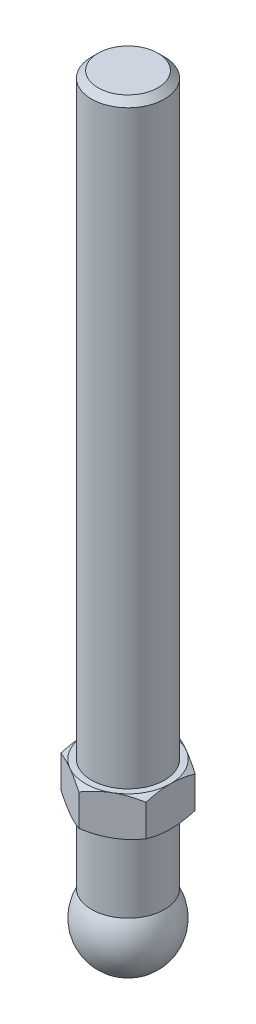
ISO-10303-21;
HEADER;
FILE_DESCRIPTION(('STEP AP214'),'2;1');
FILE_NAME('part.step','',(''),(''),'','','');
FILE_SCHEMA(('AUTOMOTIVE_DESIGN { 1 0 10303 214 1 1 1 1 }'));
ENDSEC;
DATA;
#1=APPLICATION_CONTEXT('core data for automotive mechanical design processes');
#2=APPLICATION_PROTOCOL_DEFINITION('international standard','automotive_design',2000,#1);
#3=PRODUCT_CONTEXT('',#1,'mechanical');
#4=PRODUCT('Part','Part','',(#3));
#5=PRODUCT_RELATED_PRODUCT_CATEGORY('part','',(#4));
#6=PRODUCT_DEFINITION_FORMATION('','',#4);
#7=PRODUCT_DEFINITION_CONTEXT('part definition',#1,'design');
#8=PRODUCT_DEFINITION('design','',#6,#7);
#9=PRODUCT_DEFINITION_SHAPE('','',#8);
#10=(LENGTH_UNIT() NAMED_UNIT(*) SI_UNIT(.MILLI.,.METRE.));
#11=(NAMED_UNIT(*) PLANE_ANGLE_UNIT() SI_UNIT($,.RADIAN.));
#12=(NAMED_UNIT(*) SI_UNIT($,.STERADIAN.) SOLID_ANGLE_UNIT());
#13=UNCERTAINTY_MEASURE_WITH_UNIT(LENGTH_MEASURE(1.E-05),#10,'distance_accuracy_value','');
#14=(GEOMETRIC_REPRESENTATION_CONTEXT(3) GLOBAL_UNCERTAINTY_ASSIGNED_CONTEXT((#13)) GLOBAL_UNIT_ASSIGNED_CONTEXT((#10,
#11,#12)) REPRESENTATION_CONTEXT('',''));
#15=CARTESIAN_POINT('',(0.,0.,0.));
#16=DIRECTION('',(0.,0.,1.));
#17=DIRECTION('',(1.,0.,0.));
#18=AXIS2_PLACEMENT_3D('',#15,#16,#17);
#19=CARTESIAN_POINT('',(0.,22.6,0.));
#20=DIRECTION('',(0.,-1.,0.));
#21=DIRECTION('',(0.,0.,-1.));
#22=AXIS2_PLACEMENT_3D('',#19,#20,#21);
#23=CONICAL_SURFACE('',#22,7.,1.0471975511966);
#24=CARTESIAN_POINT('',(-7.,18.5382826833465,12.1648696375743));
#25=CARTESIAN_POINT('',(-7.,18.683915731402,11.8738003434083));
#26=CARTESIAN_POINT('',(-7.,18.82854589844,11.5822239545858));
#27=CARTESIAN_POINT('',(-7.,19.1153156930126,10.997825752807));
#28=CARTESIAN_POINT('',(-7.,19.2574551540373,10.7050038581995));
#29=CARTESIAN_POINT('',(-7.,19.5390221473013,10.1173316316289));
#30=CARTESIAN_POINT('',(-7.,19.6784436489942,9.82247840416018));
#31=CARTESIAN_POINT('',(-7.,19.9536060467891,9.2310632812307));
#32=CARTESIAN_POINT('',(-7.,20.0893470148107,8.93450141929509));
#33=CARTESIAN_POINT('',(-7.,20.3623110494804,8.32593520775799));
#34=CARTESIAN_POINT('',(-7.,20.4993254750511,8.01383696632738));
#35=CARTESIAN_POINT('',(-7.,20.7671383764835,7.3869579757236));
#36=CARTESIAN_POINT('',(-7.,20.8979365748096,7.07217710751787));
#37=CARTESIAN_POINT('',(-7.,21.1515530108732,6.43962449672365));
#38=CARTESIAN_POINT('',(-7.,21.274376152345,6.12185473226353));
#39=CARTESIAN_POINT('',(-7.,21.5099016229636,5.48260317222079));
#40=CARTESIAN_POINT('',(-7.,21.6226050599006,5.16112178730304));
#41=CARTESIAN_POINT('',(-7.,21.8599014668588,4.43821731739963));
#42=CARTESIAN_POINT('',(-7.,21.981118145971,4.03566892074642));
#43=CARTESIAN_POINT('',(-7.,22.1969740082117,3.22331060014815));
#44=CARTESIAN_POINT('',(-7.,22.2916155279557,2.81350131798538));
#45=CARTESIAN_POINT('',(-7.,22.4069999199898,2.19742561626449));
#46=CARTESIAN_POINT('',(-7.,22.4408518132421,1.99359214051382));
#47=CARTESIAN_POINT('',(-7.,22.4993191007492,1.5846161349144));
#48=CARTESIAN_POINT('',(-7.,22.5239358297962,1.37947379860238));
#49=CARTESIAN_POINT('',(-7.,22.5631968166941,0.968289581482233));
#50=CARTESIAN_POINT('',(-7.,22.5778439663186,0.762247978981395));
#51=CARTESIAN_POINT('',(-7.,22.5967021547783,0.349683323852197));
#52=CARTESIAN_POINT('',(-7.,22.6009132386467,0.143160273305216));
#53=CARTESIAN_POINT('',(-7.,22.5987493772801,-0.271082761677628));
#54=CARTESIAN_POINT('',(-7.,22.5923100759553,-0.478802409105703));
#55=CARTESIAN_POINT('',(-7.,22.5689433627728,-0.893645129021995));
#56=CARTESIAN_POINT('',(-7.,22.5520159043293,-1.10076819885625));
#57=CARTESIAN_POINT('',(-7.,22.5082124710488,-1.51403043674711));
#58=CARTESIAN_POINT('',(-7.,22.4813327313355,-1.72016920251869));
#59=CARTESIAN_POINT('',(-7.,22.4184180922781,-2.13103319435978));
#60=CARTESIAN_POINT('',(-7.,22.3823828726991,-2.33575837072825));
#61=CARTESIAN_POINT('',(-7.,22.2605686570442,-2.95437912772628));
#62=CARTESIAN_POINT('',(-7.,22.1618729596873,-3.36575077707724));
#63=CARTESIAN_POINT('',(-7.,21.9384533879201,-4.1813801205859));
#64=CARTESIAN_POINT('',(-7.,21.8137148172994,-4.58563365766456));
#65=CARTESIAN_POINT('',(-7.,21.5733248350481,-5.30320893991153));
#66=CARTESIAN_POINT('',(-7.,21.4612875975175,-5.6177595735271));
#67=CARTESIAN_POINT('',(-7.,21.2278514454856,-6.24325021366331));
#68=CARTESIAN_POINT('',(-7.,21.1064551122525,-6.55419118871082));
#69=CARTESIAN_POINT('',(-7.,20.8562070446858,-7.17328528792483));
#70=CARTESIAN_POINT('',(-7.,20.7273503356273,-7.48143638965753));
#71=CARTESIAN_POINT('',(-7.,20.4637823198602,-8.09523802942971));
#72=CARTESIAN_POINT('',(-7.,20.3290706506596,-8.40088841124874));
#73=CARTESIAN_POINT('',(-7.,20.0607840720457,-8.99716345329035));
#74=CARTESIAN_POINT('',(-7.,19.9274031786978,-9.2878756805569));
#75=CARTESIAN_POINT('',(-7.,19.6571471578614,-9.86766295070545));
#76=CARTESIAN_POINT('',(-7.,19.52027208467,-10.1567380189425));
#77=CARTESIAN_POINT('',(-7.,19.2438978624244,-10.7329937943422));
#78=CARTESIAN_POINT('',(-7.,19.1044038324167,-11.0201769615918));
#79=CARTESIAN_POINT('',(-7.,18.8230228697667,-11.5933594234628));
#80=CARTESIAN_POINT('',(-7.,18.6811360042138,-11.879358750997));
#81=CARTESIAN_POINT('',(-7.,18.5382826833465,-12.1648696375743));
#82=B_SPLINE_CURVE_WITH_KNOTS('',3,(#24,#25,#26,#27,#28,#29,#30,#31,#32,#33,#34,#35,#36,#37,#38,
#39,#40,#41,#42,#43,#44,#45,#46,#47,#48,#49,#50,#51,#52,#53,#54,#55,#56,#57,#58,#59,#60,#61,#62,
#63,#64,#65,#66,#67,#68,#69,#70,#71,#72,#73,#74,#75,#76,#77,#78,#79,#80,#81),.UNSPECIFIED.,.F.,
.F.,(4,2,2,2,2,2,2,2,2,2,2,2,2,2,2,2,2,2,2,2,2,2,2,2,2,2,2,2,4),(0.,0.976413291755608,
1.95289161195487,2.93133423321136,3.90975772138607,4.93225217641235,5.95479223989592,
6.97669748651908,7.99849072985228,9.25906449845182,10.5195273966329,11.1392271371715,
11.7588372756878,12.3782676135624,12.9976952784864,13.6208795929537,14.2440666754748,
14.8674897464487,15.490934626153,16.7587972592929,18.027377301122,19.0289263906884,
20.0302002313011,21.0321496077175,22.0341611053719,22.9936838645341,23.9531917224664,
24.9109871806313,25.8687558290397),.UNSPECIFIED.);
#83=CARTESIAN_POINT('',(-7.,21.9747852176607,4.04145188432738));
#84=VERTEX_POINT('',#83);
#85=CARTESIAN_POINT('',(-7.,22.6,0.));
#86=VERTEX_POINT('',#85);
#87=EDGE_CURVE('E313',#84,#86,#82,.T.);
#88=ORIENTED_EDGE('',*,*,#87,.F.);
#89=CARTESIAN_POINT('',(0.0002,21.9747185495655,8.0830192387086));
#90=CARTESIAN_POINT('',(-0.153667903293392,22.0260001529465,7.99418356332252));
#91=CARTESIAN_POINT('',(-0.30810950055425,22.0749544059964,7.90501666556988));
#92=CARTESIAN_POINT('',(-0.618246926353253,22.1675672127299,7.72595873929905));
#93=CARTESIAN_POINT('',(-0.773943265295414,22.2112234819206,7.63606741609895));
#94=CARTESIAN_POINT('',(-1.24352516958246,22.3333884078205,7.36495417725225));
#95=CARTESIAN_POINT('',(-1.5592643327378,22.402874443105,7.18266208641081));
#96=CARTESIAN_POINT('',(-2.03176224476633,22.4843550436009,6.9098652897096));
#97=CARTESIAN_POINT('',(-2.18710922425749,22.5075665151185,6.82017566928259));
#98=CARTESIAN_POINT('',(-2.49850511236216,22.5464887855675,6.64039116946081));
#99=CARTESIAN_POINT('',(-2.65455395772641,22.5622002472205,6.55029632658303));
#100=CARTESIAN_POINT('',(-2.96692267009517,22.5857220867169,6.36995016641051));
#101=CARTESIAN_POINT('',(-3.12324202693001,22.5935414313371,6.27969914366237));
#102=CARTESIAN_POINT('',(-3.43601650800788,22.6011197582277,6.09911871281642));
#103=CARTESIAN_POINT('',(-3.59247162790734,22.600878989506,6.00878930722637));
#104=CARTESIAN_POINT('',(-4.02110687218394,22.5891402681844,5.76131663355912));
#105=CARTESIAN_POINT('',(-4.2931466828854,22.5694342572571,5.60425437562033));
#106=CARTESIAN_POINT('',(-4.8354194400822,22.5069465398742,5.29117305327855));
#107=CARTESIAN_POINT('',(-5.10565047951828,22.464143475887,5.13515508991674));
#108=CARTESIAN_POINT('',(-5.64901454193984,22.3571483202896,4.82144370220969));
#109=CARTESIAN_POINT('',(-5.92207900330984,22.2925029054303,4.66378986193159));
#110=CARTESIAN_POINT('',(-6.46413578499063,22.145783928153,4.35083323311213));
#111=CARTESIAN_POINT('',(-6.73313504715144,22.0637448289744,4.19552643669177));
#112=CARTESIAN_POINT('',(-7.0002,21.9747185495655,4.04133641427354));
#113=B_SPLINE_CURVE_WITH_KNOTS('',3,(#89,#90,#91,#92,#93,#94,#95,#96,#97,#98,#99,#100,#101,#102,
#103,#104,#105,#106,#107,#108,#109,#110,#111,#112),.UNSPECIFIED.,.F.,.F.,(4,2,2,2,2,2,2,2,2,2,2,
4),(0.,0.554727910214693,1.10969417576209,2.2219327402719,2.76443041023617,3.30688013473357,
3.8487128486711,4.39052882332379,5.33376515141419,6.27787517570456,7.2429241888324,
8.20607866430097),.UNSPECIFIED.);
#114=CARTESIAN_POINT('',(-3.5,22.6,6.06217782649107));
#115=VERTEX_POINT('',#114);
#116=EDGE_CURVE('E135',#115,#84,#113,.T.);
#117=ORIENTED_EDGE('',*,*,#116,.F.);
#118=CARTESIAN_POINT('',(0.,22.6,0.));
#119=DIRECTION('',(0.,-1.,0.));
#120=DIRECTION('',(0.,0.,-1.));
#121=AXIS2_PLACEMENT_3D('',#118,#119,#120);
#122=CIRCLE('',#121,7.);
#123=EDGE_CURVE('E283',#115,#86,#122,.T.);
#124=ORIENTED_EDGE('',*,*,#123,.T.);
#125=EDGE_LOOP('',(#88,#117,#124));
#126=FACE_BOUND('',#125,.T.);
#127=ADVANCED_FACE('F14',(#126),#23,.T.);
#128=CARTESIAN_POINT('',(-7.,21.9747852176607,-4.04145188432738));
#129=VERTEX_POINT('',#128);
#130=EDGE_CURVE('E193',#86,#129,#82,.T.);
#131=ORIENTED_EDGE('',*,*,#130,.F.);
#132=CARTESIAN_POINT('',(-3.5,22.6,-6.06217782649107));
#133=VERTEX_POINT('',#132);
#134=EDGE_CURVE('E195',#86,#133,#122,.T.);
#135=ORIENTED_EDGE('',*,*,#134,.T.);
#136=CARTESIAN_POINT('',(-7.0002,21.9747185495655,-4.04133641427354));
#137=CARTESIAN_POINT('',(-6.84633209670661,22.0260001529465,-4.13017208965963));
#138=CARTESIAN_POINT('',(-6.69189049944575,22.0749544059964,-4.21933898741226));
#139=CARTESIAN_POINT('',(-6.38175307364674,22.1675672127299,-4.39839691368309));
#140=CARTESIAN_POINT('',(-6.22605673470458,22.2112234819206,-4.48828823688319));
#141=CARTESIAN_POINT('',(-5.75647483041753,22.3333884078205,-4.75940147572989));
#142=CARTESIAN_POINT('',(-5.4407356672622,22.402874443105,-4.94169356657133));
#143=CARTESIAN_POINT('',(-4.96823775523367,22.4843550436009,-5.21449036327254));
#144=CARTESIAN_POINT('',(-4.81289077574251,22.5075665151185,-5.30417998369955));
#145=CARTESIAN_POINT('',(-4.50149488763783,22.5464887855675,-5.48396448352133));
#146=CARTESIAN_POINT('',(-4.34544604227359,22.5622002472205,-5.57405932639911));
#147=CARTESIAN_POINT('',(-4.03307732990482,22.5857220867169,-5.75440548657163));
#148=CARTESIAN_POINT('',(-3.87675797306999,22.5935414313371,-5.84465650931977));
#149=CARTESIAN_POINT('',(-3.56398349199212,22.6011197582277,-6.02523694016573));
#150=CARTESIAN_POINT('',(-3.40752837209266,22.600878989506,-6.11556634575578));
#151=CARTESIAN_POINT('',(-2.97889312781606,22.5891402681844,-6.36303901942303));
#152=CARTESIAN_POINT('',(-2.7068533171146,22.5694342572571,-6.52010127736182));
#153=CARTESIAN_POINT('',(-2.1645805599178,22.5069465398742,-6.83318259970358));
#154=CARTESIAN_POINT('',(-1.89434952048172,22.464143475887,-6.9892005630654));
#155=CARTESIAN_POINT('',(-1.35098545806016,22.3571483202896,-7.30291195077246));
#156=CARTESIAN_POINT('',(-1.07792099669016,22.2925029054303,-7.46056579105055));
#157=CARTESIAN_POINT('',(-0.53586421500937,22.145783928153,-7.77352241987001));
#158=CARTESIAN_POINT('',(-0.266864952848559,22.0637448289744,-7.92882921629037));
#159=CARTESIAN_POINT('',(0.000200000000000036,21.9747185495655,-8.0830192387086));
#160=B_SPLINE_CURVE_WITH_KNOTS('',3,(#136,#137,#138,#139,#140,#141,#142,#143,#144,#145,#146,
#147,#148,#149,#150,#151,#152,#153,#154,#155,#156,#157,#158,#159),.UNSPECIFIED.,.F.,.F.,(4,2,2,
2,2,2,2,2,2,2,2,4),(0.,0.554727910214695,1.10969417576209,2.2219327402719,2.76443041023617,
3.30688013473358,3.8487128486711,4.39052882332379,5.33376515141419,6.27787517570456,
7.2429241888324,8.20607866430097),.UNSPECIFIED.);
#161=EDGE_CURVE('E183',#129,#133,#160,.T.);
#162=ORIENTED_EDGE('',*,*,#161,.F.);
#163=EDGE_LOOP('',(#131,#135,#162));
#164=FACE_BOUND('',#163,.T.);
#165=ADVANCED_FACE('F192',(#164),#23,.T.);
#166=CARTESIAN_POINT('',(0.,21.9747852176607,-8.08290376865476));
#167=VERTEX_POINT('',#166);
#168=EDGE_CURVE('E197',#133,#167,#160,.T.);
#169=ORIENTED_EDGE('',*,*,#168,.F.);
#170=CARTESIAN_POINT('',(3.5,22.6,-6.06217782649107));
#171=VERTEX_POINT('',#170);
#172=EDGE_CURVE('E293',#133,#171,#122,.T.);
#173=ORIENTED_EDGE('',*,*,#172,.T.);
#174=CARTESIAN_POINT('',(-0.0002,21.9747185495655,-8.0830192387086));
#175=CARTESIAN_POINT('',(0.153667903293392,22.0260001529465,-7.99418356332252));
#176=CARTESIAN_POINT('',(0.30810950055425,22.0749544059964,-7.90501666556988));
#177=CARTESIAN_POINT('',(0.618246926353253,22.1675672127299,-7.72595873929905));
#178=CARTESIAN_POINT('',(0.773943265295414,22.2112234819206,-7.63606741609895));
#179=CARTESIAN_POINT('',(1.24352516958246,22.3333884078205,-7.36495417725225));
#180=CARTESIAN_POINT('',(1.5592643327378,22.402874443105,-7.18266208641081));
#181=CARTESIAN_POINT('',(2.03176224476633,22.4843550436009,-6.9098652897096));
#182=CARTESIAN_POINT('',(2.18710922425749,22.5075665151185,-6.82017566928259));
#183=CARTESIAN_POINT('',(2.49850511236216,22.5464887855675,-6.64039116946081));
#184=CARTESIAN_POINT('',(2.65455395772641,22.5622002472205,-6.55029632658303));
#185=CARTESIAN_POINT('',(2.96692267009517,22.5857220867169,-6.36995016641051));
#186=CARTESIAN_POINT('',(3.12324202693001,22.5935414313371,-6.27969914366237));
#187=CARTESIAN_POINT('',(3.43601650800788,22.6011197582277,-6.09911871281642));
#188=CARTESIAN_POINT('',(3.59247162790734,22.600878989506,-6.00878930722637));
#189=CARTESIAN_POINT('',(4.02110687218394,22.5891402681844,-5.76131663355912));
#190=CARTESIAN_POINT('',(4.2931466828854,22.5694342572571,-5.60425437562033));
#191=CARTESIAN_POINT('',(4.8354194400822,22.5069465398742,-5.29117305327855));
#192=CARTESIAN_POINT('',(5.10565047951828,22.464143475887,-5.13515508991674));
#193=CARTESIAN_POINT('',(5.64901454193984,22.3571483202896,-4.82144370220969));
#194=CARTESIAN_POINT('',(5.92207900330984,22.2925029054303,-4.66378986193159));
#195=CARTESIAN_POINT('',(6.46413578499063,22.145783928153,-4.35083323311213));
#196=CARTESIAN_POINT('',(6.73313504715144,22.0637448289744,-4.19552643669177));
#197=CARTESIAN_POINT('',(7.0002,21.9747185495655,-4.04133641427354));
#198=B_SPLINE_CURVE_WITH_KNOTS('',3,(#174,#175,#176,#177,#178,#179,#180,#181,#182,#183,#184,
#185,#186,#187,#188,#189,#190,#191,#192,#193,#194,#195,#196,#197),.UNSPECIFIED.,.F.,.F.,(4,2,2,
2,2,2,2,2,2,2,2,4),(0.,0.554727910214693,1.10969417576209,2.2219327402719,2.76443041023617,
3.30688013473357,3.8487128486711,4.39052882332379,5.33376515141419,6.27787517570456,
7.2429241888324,8.20607866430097),.UNSPECIFIED.);
#199=EDGE_CURVE('E243',#167,#171,#198,.T.);
#200=ORIENTED_EDGE('',*,*,#199,.F.);
#201=EDGE_LOOP('',(#169,#173,#200));
#202=FACE_BOUND('',#201,.T.);
#203=ADVANCED_FACE('F346',(#202),#23,.T.);
#204=CARTESIAN_POINT('',(7.,21.9747852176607,-4.04145188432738));
#205=VERTEX_POINT('',#204);
#206=EDGE_CURVE('E238',#171,#205,#198,.T.);
#207=ORIENTED_EDGE('',*,*,#206,.F.);
#208=CARTESIAN_POINT('',(7.,22.6,0.));
#209=VERTEX_POINT('',#208);
#210=EDGE_CURVE('E288',#171,#209,#122,.T.);
#211=ORIENTED_EDGE('',*,*,#210,.T.);
#212=CARTESIAN_POINT('',(7.,18.5382826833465,-12.1648696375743));
#213=CARTESIAN_POINT('',(7.,18.683915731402,-11.8738003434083));
#214=CARTESIAN_POINT('',(7.,18.82854589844,-11.5822239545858));
#215=CARTESIAN_POINT('',(7.,19.1153156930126,-10.997825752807));
#216=CARTESIAN_POINT('',(7.,19.2574551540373,-10.7050038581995));
#217=CARTESIAN_POINT('',(7.,19.5390221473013,-10.1173316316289));
#218=CARTESIAN_POINT('',(7.,19.6784436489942,-9.82247840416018));
#219=CARTESIAN_POINT('',(7.,19.9536060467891,-9.2310632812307));
#220=CARTESIAN_POINT('',(7.,20.0893470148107,-8.93450141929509));
#221=CARTESIAN_POINT('',(7.,20.3623110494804,-8.32593520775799));
#222=CARTESIAN_POINT('',(7.,20.4993254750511,-8.01383696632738));
#223=CARTESIAN_POINT('',(7.,20.7671383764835,-7.3869579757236));
#224=CARTESIAN_POINT('',(7.,20.8979365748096,-7.07217710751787));
#225=CARTESIAN_POINT('',(7.,21.1515530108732,-6.43962449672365));
#226=CARTESIAN_POINT('',(7.,21.274376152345,-6.12185473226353));
#227=CARTESIAN_POINT('',(7.,21.5099016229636,-5.48260317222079));
#228=CARTESIAN_POINT('',(7.,21.6226050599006,-5.16112178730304));
#229=CARTESIAN_POINT('',(7.,21.8599014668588,-4.43821731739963));
#230=CARTESIAN_POINT('',(7.,21.981118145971,-4.03566892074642));
#231=CARTESIAN_POINT('',(7.,22.1969740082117,-3.22331060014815));
#232=CARTESIAN_POINT('',(7.,22.2916155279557,-2.81350131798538));
#233=CARTESIAN_POINT('',(7.,22.4069999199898,-2.19742561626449));
#234=CARTESIAN_POINT('',(7.,22.4408518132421,-1.99359214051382));
#235=CARTESIAN_POINT('',(7.,22.4993191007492,-1.5846161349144));
#236=CARTESIAN_POINT('',(7.,22.5239358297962,-1.37947379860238));
#237=CARTESIAN_POINT('',(7.,22.5631968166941,-0.968289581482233));
#238=CARTESIAN_POINT('',(7.,22.5778439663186,-0.762247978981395));
#239=CARTESIAN_POINT('',(7.,22.5967021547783,-0.349683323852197));
#240=CARTESIAN_POINT('',(7.,22.6009132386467,-0.143160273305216));
#241=CARTESIAN_POINT('',(7.,22.5987493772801,0.271082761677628));
#242=CARTESIAN_POINT('',(7.,22.5923100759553,0.478802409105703));
#243=CARTESIAN_POINT('',(7.,22.5689433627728,0.893645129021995));
#244=CARTESIAN_POINT('',(7.,22.5520159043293,1.10076819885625));
#245=CARTESIAN_POINT('',(7.,22.5082124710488,1.51403043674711));
#246=CARTESIAN_POINT('',(7.,22.4813327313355,1.72016920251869));
#247=CARTESIAN_POINT('',(7.,22.4184180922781,2.13103319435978));
#248=CARTESIAN_POINT('',(7.,22.3823828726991,2.33575837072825));
#249=CARTESIAN_POINT('',(7.,22.2605686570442,2.95437912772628));
#250=CARTESIAN_POINT('',(7.,22.1618729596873,3.36575077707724));
#251=CARTESIAN_POINT('',(7.,21.9384533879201,4.1813801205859));
#252=CARTESIAN_POINT('',(7.,21.8137148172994,4.58563365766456));
#253=CARTESIAN_POINT('',(7.,21.5733248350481,5.30320893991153));
#254=CARTESIAN_POINT('',(7.,21.4612875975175,5.6177595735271));
#255=CARTESIAN_POINT('',(7.,21.2278514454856,6.24325021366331));
#256=CARTESIAN_POINT('',(7.,21.1064551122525,6.55419118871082));
#257=CARTESIAN_POINT('',(7.,20.8562070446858,7.17328528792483));
#258=CARTESIAN_POINT('',(7.,20.7273503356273,7.48143638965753));
#259=CARTESIAN_POINT('',(7.,20.4637823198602,8.09523802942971));
#260=CARTESIAN_POINT('',(7.,20.3290706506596,8.40088841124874));
#261=CARTESIAN_POINT('',(7.,20.0607840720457,8.99716345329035));
#262=CARTESIAN_POINT('',(7.,19.9274031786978,9.2878756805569));
#263=CARTESIAN_POINT('',(7.,19.6571471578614,9.86766295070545));
#264=CARTESIAN_POINT('',(7.,19.52027208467,10.1567380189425));
#265=CARTESIAN_POINT('',(7.,19.2438978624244,10.7329937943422));
#266=CARTESIAN_POINT('',(7.,19.1044038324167,11.0201769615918));
#267=CARTESIAN_POINT('',(7.,18.8230228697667,11.5933594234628));
#268=CARTESIAN_POINT('',(7.,18.6811360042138,11.879358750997));
#269=CARTESIAN_POINT('',(7.,18.5382826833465,12.1648696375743));
#270=B_SPLINE_CURVE_WITH_KNOTS('',3,(#212,#213,#214,#215,#216,#217,#218,#219,#220,#221,#222,
#223,#224,#225,#226,#227,#228,#229,#230,#231,#232,#233,#234,#235,#236,#237,#238,#239,#240,#241,
#242,#243,#244,#245,#246,#247,#248,#249,#250,#251,#252,#253,#254,#255,#256,#257,#258,#259,#260,
#261,#262,#263,#264,#265,#266,#267,#268,#269),.UNSPECIFIED.,.F.,.F.,(4,2,2,2,2,2,2,2,2,2,2,2,2,
2,2,2,2,2,2,2,2,2,2,2,2,2,2,2,4),(0.,0.976413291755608,1.95289161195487,2.93133423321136,
3.90975772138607,4.93225217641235,5.95479223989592,6.97669748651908,7.99849072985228,
9.25906449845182,10.5195273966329,11.1392271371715,11.7588372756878,12.3782676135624,
12.9976952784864,13.6208795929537,14.2440666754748,14.8674897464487,15.490934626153,
16.7587972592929,18.027377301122,19.0289263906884,20.0302002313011,21.0321496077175,
22.0341611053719,22.9936838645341,23.9531917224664,24.9109871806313,25.8687558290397),.UNSPECIFIED.);
#271=EDGE_CURVE('E249',#205,#209,#270,.T.);
#272=ORIENTED_EDGE('',*,*,#271,.F.);
#273=EDGE_LOOP('',(#207,#211,#272));
#274=FACE_BOUND('',#273,.T.);
#275=ADVANCED_FACE('F356',(#274),#23,.T.);
#276=CARTESIAN_POINT('',(7.,21.9747852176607,4.04145188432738));
#277=VERTEX_POINT('',#276);
#278=EDGE_CURVE('E251',#209,#277,#270,.T.);
#279=ORIENTED_EDGE('',*,*,#278,.F.);
#280=CARTESIAN_POINT('',(3.5,22.6,6.06217782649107));
#281=VERTEX_POINT('',#280);
#282=EDGE_CURVE('E281',#209,#281,#122,.T.);
#283=ORIENTED_EDGE('',*,*,#282,.T.);
#284=CARTESIAN_POINT('',(7.0002,21.9747185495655,4.04133641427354));
#285=CARTESIAN_POINT('',(6.84633209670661,22.0260001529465,4.13017208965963));
#286=CARTESIAN_POINT('',(6.69189049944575,22.0749544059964,4.21933898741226));
#287=CARTESIAN_POINT('',(6.38175307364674,22.1675672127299,4.39839691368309));
#288=CARTESIAN_POINT('',(6.22605673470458,22.2112234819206,4.48828823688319));
#289=CARTESIAN_POINT('',(5.75647483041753,22.3333884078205,4.75940147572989));
#290=CARTESIAN_POINT('',(5.4407356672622,22.402874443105,4.94169356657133));
#291=CARTESIAN_POINT('',(4.96823775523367,22.4843550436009,5.21449036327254));
#292=CARTESIAN_POINT('',(4.81289077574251,22.5075665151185,5.30417998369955));
#293=CARTESIAN_POINT('',(4.50149488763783,22.5464887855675,5.48396448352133));
#294=CARTESIAN_POINT('',(4.34544604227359,22.5622002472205,5.57405932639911));
#295=CARTESIAN_POINT('',(4.03307732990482,22.5857220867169,5.75440548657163));
#296=CARTESIAN_POINT('',(3.87675797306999,22.5935414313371,5.84465650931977));
#297=CARTESIAN_POINT('',(3.56398349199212,22.6011197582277,6.02523694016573));
#298=CARTESIAN_POINT('',(3.40752837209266,22.600878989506,6.11556634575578));
#299=CARTESIAN_POINT('',(2.97889312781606,22.5891402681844,6.36303901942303));
#300=CARTESIAN_POINT('',(2.7068533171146,22.5694342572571,6.52010127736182));
#301=CARTESIAN_POINT('',(2.1645805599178,22.5069465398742,6.83318259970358));
#302=CARTESIAN_POINT('',(1.89434952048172,22.464143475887,6.9892005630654));
#303=CARTESIAN_POINT('',(1.35098545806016,22.3571483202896,7.30291195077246));
#304=CARTESIAN_POINT('',(1.07792099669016,22.2925029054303,7.46056579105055));
#305=CARTESIAN_POINT('',(0.53586421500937,22.145783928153,7.77352241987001));
#306=CARTESIAN_POINT('',(0.266864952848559,22.0637448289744,7.92882921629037));
#307=CARTESIAN_POINT('',(-0.000200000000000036,21.9747185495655,8.0830192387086));
#308=B_SPLINE_CURVE_WITH_KNOTS('',3,(#284,#285,#286,#287,#288,#289,#290,#291,#292,#293,#294,
#295,#296,#297,#298,#299,#300,#301,#302,#303,#304,#305,#306,#307),.UNSPECIFIED.,.F.,.F.,(4,2,2,
2,2,2,2,2,2,2,2,4),(0.,0.554727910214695,1.10969417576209,2.2219327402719,2.76443041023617,
3.30688013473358,3.8487128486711,4.39052882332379,5.33376515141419,6.27787517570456,
7.2429241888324,8.20607866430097),.UNSPECIFIED.);
#309=EDGE_CURVE('E126',#277,#281,#308,.T.);
#310=ORIENTED_EDGE('',*,*,#309,.F.);
#311=EDGE_LOOP('',(#279,#283,#310));
#312=FACE_BOUND('',#311,.T.);
#313=ADVANCED_FACE('F285',(#312),#23,.T.);
#314=CARTESIAN_POINT('',(0.,21.9747852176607,8.08290376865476));
#315=VERTEX_POINT('',#314);
#316=EDGE_CURVE('E116',#281,#315,#308,.T.);
#317=ORIENTED_EDGE('',*,*,#316,.F.);
#318=EDGE_CURVE('E274',#281,#115,#122,.T.);
#319=ORIENTED_EDGE('',*,*,#318,.T.);
#320=EDGE_CURVE('E29',#315,#115,#113,.T.);
#321=ORIENTED_EDGE('',*,*,#320,.F.);
#322=EDGE_LOOP('',(#317,#319,#321));
#323=FACE_BOUND('',#322,.T.);
#324=ADVANCED_FACE('F273',(#323),#23,.T.);
#325=CARTESIAN_POINT('',(0.,120.6,0.));
#326=DIRECTION('',(0.,-1.,0.));
#327=DIRECTION('',(0.,0.,-1.));
#328=AXIS2_PLACEMENT_3D('',#325,#326,#327);
#329=PLANE('',#328);
#330=CARTESIAN_POINT('',(0.,120.6,0.));
#331=DIRECTION('',(0.,-1.,0.));
#332=DIRECTION('',(0.,0.,-1.));
#333=AXIS2_PLACEMENT_3D('',#330,#331,#332);
#334=CIRCLE('',#333,4.9265);
#335=CARTESIAN_POINT('',(0.,120.6,-4.9265));
#336=VERTEX_POINT('',#335);
#337=EDGE_CURVE('E22',#336,#336,#334,.T.);
#338=ORIENTED_EDGE('',*,*,#337,.F.);
#339=EDGE_LOOP('',(#338));
#340=FACE_BOUND('',#339,.T.);
#341=ADVANCED_FACE('F16',(#340),#329,.F.);
#342=CARTESIAN_POINT('',(0.,120.6,0.));
#343=DIRECTION('',(0.,-1.,0.));
#344=DIRECTION('',(0.,0.,-1.));
#345=AXIS2_PLACEMENT_3D('',#342,#343,#344);
#346=CONICAL_SURFACE('',#345,4.9265,0.785398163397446);
#347=CARTESIAN_POINT('',(0.,119.5265,0.));
#348=DIRECTION('',(0.,-1.,0.));
#349=DIRECTION('',(0.,0.,-1.));
#350=AXIS2_PLACEMENT_3D('',#347,#348,#349);
#351=CIRCLE('',#350,6.);
#352=CARTESIAN_POINT('',(0.,119.5265,-6.));
#353=VERTEX_POINT('',#352);
#354=EDGE_CURVE('E290',#353,#353,#351,.T.);
#355=ORIENTED_EDGE('',*,*,#354,.F.);
#356=EDGE_LOOP('',(#355));
#357=FACE_BOUND('',#356,.T.);
#358=ORIENTED_EDGE('',*,*,#337,.T.);
#359=EDGE_LOOP('',(#358));
#360=FACE_BOUND('',#359,.T.);
#361=ADVANCED_FACE('F354',(#357,#360),#346,.T.);
#362=CARTESIAN_POINT('',(0.,-7.,0.));
#363=DIRECTION('',(0.,-1.,0.));
#364=DIRECTION('',(0.,0.,-1.));
#365=AXIS2_PLACEMENT_3D('',#362,#363,#364);
#366=CYLINDRICAL_SURFACE('',#365,6.);
#367=CARTESIAN_POINT('',(0.,22.6,0.));
#368=DIRECTION('',(0.,-1.,0.));
#369=DIRECTION('',(0.,0.,-1.));
#370=AXIS2_PLACEMENT_3D('',#367,#368,#369);
#371=CIRCLE('',#370,6.);
#372=CARTESIAN_POINT('',(0.,22.6,-6.));
#373=VERTEX_POINT('',#372);
#374=EDGE_CURVE('E287',#373,#373,#371,.T.);
#375=ORIENTED_EDGE('',*,*,#374,.F.);
#376=EDGE_LOOP('',(#375));
#377=FACE_BOUND('',#376,.T.);
#378=ORIENTED_EDGE('',*,*,#354,.T.);
#379=EDGE_LOOP('',(#378));
#380=FACE_BOUND('',#379,.T.);
#381=ADVANCED_FACE('F439',(#377,#380),#366,.T.);
#382=CARTESIAN_POINT('',(6.,22.6,0.));
#383=DIRECTION('',(0.,-1.,0.));
#384=DIRECTION('',(0.,0.,-1.));
#385=AXIS2_PLACEMENT_3D('',#382,#383,#384);
#386=PLANE('',#385);
#387=ORIENTED_EDGE('',*,*,#282,.F.);
#388=ORIENTED_EDGE('',*,*,#210,.F.);
#389=ORIENTED_EDGE('',*,*,#172,.F.);
#390=ORIENTED_EDGE('',*,*,#134,.F.);
#391=ORIENTED_EDGE('',*,*,#123,.F.);
#392=ORIENTED_EDGE('',*,*,#318,.F.);
#393=EDGE_LOOP('',(#387,#388,#389,#390,#391,#392));
#394=FACE_BOUND('',#393,.T.);
#395=ORIENTED_EDGE('',*,*,#374,.T.);
#396=EDGE_LOOP('',(#395));
#397=FACE_BOUND('',#396,.T.);
#398=ADVANCED_FACE('F278',(#394,#397),#386,.F.);
#399=CARTESIAN_POINT('',(-7.,16.15,-4.04145188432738));
#400=DIRECTION('',(-1.,0.,0.));
#401=DIRECTION('',(0.,0.,1.));
#402=AXIS2_PLACEMENT_3D('',#399,#400,#401);
#403=PLANE('',#402);
#404=ORIENTED_EDGE('',*,*,#87,.T.);
#405=ORIENTED_EDGE('',*,*,#130,.T.);
#406=DIRECTION('',(0.,1.,0.));
#407=VECTOR('',#406,1.);
#408=CARTESIAN_POINT('',(-7.,16.15,-4.04145188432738));
#409=LINE('',#408,#407);
#410=CARTESIAN_POINT('',(-7.,16.7752147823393,-4.04145188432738));
#411=VERTEX_POINT('',#410);
#412=EDGE_CURVE('E109',#411,#129,#409,.T.);
#413=ORIENTED_EDGE('',*,*,#412,.F.);
#414=CARTESIAN_POINT('',(-7.,20.2117173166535,-12.1648696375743));
#415=CARTESIAN_POINT('',(-7.,20.066084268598,-11.8738003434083));
#416=CARTESIAN_POINT('',(-7.,19.9214541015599,-11.5822239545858));
#417=CARTESIAN_POINT('',(-7.,19.6346843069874,-10.997825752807));
#418=CARTESIAN_POINT('',(-7.,19.4925448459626,-10.7050038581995));
#419=CARTESIAN_POINT('',(-7.,19.2109778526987,-10.117331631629));
#420=CARTESIAN_POINT('',(-7.,19.0715563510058,-9.82247840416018));
#421=CARTESIAN_POINT('',(-7.,18.7963939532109,-9.2310632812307));
#422=CARTESIAN_POINT('',(-7.,18.6606529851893,-8.93450141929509));
#423=CARTESIAN_POINT('',(-7.,18.3876889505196,-8.32593520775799));
#424=CARTESIAN_POINT('',(-7.,18.2506745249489,-8.01383696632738));
#425=CARTESIAN_POINT('',(-7.,17.9828616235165,-7.38695797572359));
#426=CARTESIAN_POINT('',(-7.,17.8520634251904,-7.07217710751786));
#427=CARTESIAN_POINT('',(-7.,17.5984469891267,-6.43962449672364));
#428=CARTESIAN_POINT('',(-7.,17.475623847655,-6.12185473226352));
#429=CARTESIAN_POINT('',(-7.,17.2400983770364,-5.48260317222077));
#430=CARTESIAN_POINT('',(-7.,17.1273949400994,-5.16112178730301));
#431=CARTESIAN_POINT('',(-7.,16.8900985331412,-4.43821731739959));
#432=CARTESIAN_POINT('',(-7.,16.768881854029,-4.0356689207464));
#433=CARTESIAN_POINT('',(-7.,16.5530259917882,-3.22331060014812));
#434=CARTESIAN_POINT('',(-7.,16.4583844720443,-2.81350131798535));
#435=CARTESIAN_POINT('',(-7.,16.3430000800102,-2.19742561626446));
#436=CARTESIAN_POINT('',(-7.,16.3091481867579,-1.99359214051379));
#437=CARTESIAN_POINT('',(-7.,16.2506808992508,-1.58461613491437));
#438=CARTESIAN_POINT('',(-7.,16.2260641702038,-1.37947379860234));
#439=CARTESIAN_POINT('',(-7.,16.1868031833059,-0.968289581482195));
#440=CARTESIAN_POINT('',(-7.,16.1721560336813,-0.762247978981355));
#441=CARTESIAN_POINT('',(-7.,16.1532978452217,-0.349683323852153));
#442=CARTESIAN_POINT('',(-7.,16.1490867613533,-0.143160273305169));
#443=CARTESIAN_POINT('',(-7.,16.1512506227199,0.271082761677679));
#444=CARTESIAN_POINT('',(-7.,16.1576899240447,0.478802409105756));
#445=CARTESIAN_POINT('',(-7.,16.1810566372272,0.893645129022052));
#446=CARTESIAN_POINT('',(-7.,16.1979840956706,1.10076819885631));
#447=CARTESIAN_POINT('',(-7.,16.2417875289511,1.51403043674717));
#448=CARTESIAN_POINT('',(-7.,16.2686672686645,1.72016920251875));
#449=CARTESIAN_POINT('',(-7.,16.3315819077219,2.13103319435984));
#450=CARTESIAN_POINT('',(-7.,16.3676171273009,2.33575837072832));
#451=CARTESIAN_POINT('',(-7.,16.4894313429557,2.95437912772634));
#452=CARTESIAN_POINT('',(-7.,16.5881270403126,3.36575077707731));
#453=CARTESIAN_POINT('',(-7.,16.8115466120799,4.18138012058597));
#454=CARTESIAN_POINT('',(-7.,16.9362851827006,4.58563365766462));
#455=CARTESIAN_POINT('',(-7.,17.1766751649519,5.3032089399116));
#456=CARTESIAN_POINT('',(-7.,17.2887124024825,5.61775957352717));
#457=CARTESIAN_POINT('',(-7.,17.5221485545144,6.24325021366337));
#458=CARTESIAN_POINT('',(-7.,17.6435448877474,6.55419118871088));
#459=CARTESIAN_POINT('',(-7.,17.8937929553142,7.17328528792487));
#460=CARTESIAN_POINT('',(-7.,18.0226496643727,7.48143638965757));
#461=CARTESIAN_POINT('',(-7.,18.2862176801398,8.09523802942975));
#462=CARTESIAN_POINT('',(-7.,18.4209293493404,8.40088841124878));
#463=CARTESIAN_POINT('',(-7.,18.6892159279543,8.99716345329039));
#464=CARTESIAN_POINT('',(-7.,18.8225968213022,9.28787568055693));
#465=CARTESIAN_POINT('',(-7.,19.0928528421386,9.86766295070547));
#466=CARTESIAN_POINT('',(-7.,19.22972791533,10.1567380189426));
#467=CARTESIAN_POINT('',(-7.,19.5061021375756,10.7329937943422));
#468=CARTESIAN_POINT('',(-7.,19.6455961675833,11.0201769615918));
#469=CARTESIAN_POINT('',(-7.,19.9269771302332,11.5933594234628));
#470=CARTESIAN_POINT('',(-7.,20.0688639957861,11.879358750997));
#471=CARTESIAN_POINT('',(-7.,20.2117173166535,12.1648696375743));
#472=B_SPLINE_CURVE_WITH_KNOTS('',3,(#414,#415,#416,#417,#418,#419,#420,#421,#422,#423,#424,
#425,#426,#427,#428,#429,#430,#431,#432,#433,#434,#435,#436,#437,#438,#439,#440,#441,#442,#443,
#444,#445,#446,#447,#448,#449,#450,#451,#452,#453,#454,#455,#456,#457,#458,#459,#460,#461,#462,
#463,#464,#465,#466,#467,#468,#469,#470,#471),.UNSPECIFIED.,.F.,.F.,(4,2,2,2,2,2,2,2,2,2,2,2,2,
2,2,2,2,2,2,2,2,2,2,2,2,2,2,2,4),(0.,0.976413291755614,1.95289161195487,2.93133423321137,
3.90975772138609,4.93225217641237,5.95479223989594,6.9766974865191,7.99849072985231,
9.25906449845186,10.5195273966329,11.1392271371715,11.7588372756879,12.3782676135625,
12.9976952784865,13.6208795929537,14.2440666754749,14.8674897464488,15.4909346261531,
16.758797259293,18.0273773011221,19.0289263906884,20.0302002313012,21.0321496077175,
22.0341611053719,22.9936838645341,23.9531917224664,24.9109871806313,25.8687558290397),.UNSPECIFIED.);
#473=CARTESIAN_POINT('',(-7.,16.15,0.));
#474=VERTEX_POINT('',#473);
#475=EDGE_CURVE('E199',#411,#474,#472,.T.);
#476=ORIENTED_EDGE('',*,*,#475,.T.);
#477=CARTESIAN_POINT('',(-7.,16.7752147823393,4.04145188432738));
#478=VERTEX_POINT('',#477);
#479=EDGE_CURVE('E196',#474,#478,#472,.T.);
#480=ORIENTED_EDGE('',*,*,#479,.T.);
#481=DIRECTION('',(0.,1.,0.));
#482=VECTOR('',#481,1.);
#483=CARTESIAN_POINT('',(-7.,16.15,4.04145188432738));
#484=LINE('',#483,#482);
#485=EDGE_CURVE('E118',#478,#84,#484,.T.);
#486=ORIENTED_EDGE('',*,*,#485,.T.);
#487=EDGE_LOOP('',(#404,#405,#413,#476,#480,#486));
#488=FACE_BOUND('',#487,.T.);
#489=ADVANCED_FACE('F224',(#488),#403,.T.);
#490=CARTESIAN_POINT('',(0.,16.15,-8.08290376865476));
#491=DIRECTION('',(-0.5,0.,-0.866025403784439));
#492=DIRECTION('',(-0.866025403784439,0.,0.5));
#493=AXIS2_PLACEMENT_3D('',#490,#491,#492);
#494=PLANE('',#493);
#495=ORIENTED_EDGE('',*,*,#161,.T.);
#496=ORIENTED_EDGE('',*,*,#168,.T.);
#497=DIRECTION('',(0.,1.,0.));
#498=VECTOR('',#497,1.);
#499=CARTESIAN_POINT('',(0.,16.15,-8.08290376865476));
#500=LINE('',#499,#498);
#501=CARTESIAN_POINT('',(0.,16.7752147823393,-8.08290376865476));
#502=VERTEX_POINT('',#501);
#503=EDGE_CURVE('E175',#502,#167,#500,.T.);
#504=ORIENTED_EDGE('',*,*,#503,.F.);
#505=CARTESIAN_POINT('',(0.000200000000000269,16.7752814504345,-8.0830192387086));
#506=CARTESIAN_POINT('',(-0.153667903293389,16.7239998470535,-7.99418356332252));
#507=CARTESIAN_POINT('',(-0.308109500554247,16.6750455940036,-7.90501666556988));
#508=CARTESIAN_POINT('',(-0.618246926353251,16.5824327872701,-7.72595873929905));
#509=CARTESIAN_POINT('',(-0.773943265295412,16.5387765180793,-7.63606741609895));
#510=CARTESIAN_POINT('',(-1.24352516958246,16.4166115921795,-7.36495417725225));
#511=CARTESIAN_POINT('',(-1.5592643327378,16.3471255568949,-7.18266208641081));
#512=CARTESIAN_POINT('',(-2.03176224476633,16.2656449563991,-6.9098652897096));
#513=CARTESIAN_POINT('',(-2.18710922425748,16.2424334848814,-6.82017566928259));
#514=CARTESIAN_POINT('',(-2.49850511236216,16.2035112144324,-6.64039116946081));
#515=CARTESIAN_POINT('',(-2.65455395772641,16.1877997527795,-6.55029632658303));
#516=CARTESIAN_POINT('',(-2.96692267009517,16.164277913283,-6.36995016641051));
#517=CARTESIAN_POINT('',(-3.12324202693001,16.1564585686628,-6.27969914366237));
#518=CARTESIAN_POINT('',(-3.43601650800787,16.1488802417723,-6.09911871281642));
#519=CARTESIAN_POINT('',(-3.59247162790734,16.149121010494,-6.00878930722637));
#520=CARTESIAN_POINT('',(-4.02110687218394,16.1608597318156,-5.76131663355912));
#521=CARTESIAN_POINT('',(-4.2931466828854,16.1805657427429,-5.60425437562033));
#522=CARTESIAN_POINT('',(-4.8354194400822,16.2430534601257,-5.29117305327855));
#523=CARTESIAN_POINT('',(-5.10565047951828,16.285856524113,-5.13515508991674));
#524=CARTESIAN_POINT('',(-5.64901454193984,16.3928516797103,-4.82144370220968));
#525=CARTESIAN_POINT('',(-5.92207900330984,16.4574970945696,-4.66378986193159));
#526=CARTESIAN_POINT('',(-6.46413578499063,16.604216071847,-4.35083323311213));
#527=CARTESIAN_POINT('',(-6.73313504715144,16.6862551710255,-4.19552643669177));
#528=CARTESIAN_POINT('',(-7.0002,16.7752814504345,-4.04133641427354));
#529=B_SPLINE_CURVE_WITH_KNOTS('',3,(#505,#506,#507,#508,#509,#510,#511,#512,#513,#514,#515,
#516,#517,#518,#519,#520,#521,#522,#523,#524,#525,#526,#527,#528),.UNSPECIFIED.,.F.,.F.,(4,2,2,
2,2,2,2,2,2,2,2,4),(0.,0.554727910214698,1.1096941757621,2.2219327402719,2.76443041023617,
3.30688013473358,3.8487128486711,4.3905288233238,5.3337651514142,6.27787517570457,
7.24292418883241,8.20607866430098),.UNSPECIFIED.);
#530=CARTESIAN_POINT('',(-3.5,16.15,-6.06217782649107));
#531=VERTEX_POINT('',#530);
#532=EDGE_CURVE('E201',#502,#531,#529,.T.);
#533=ORIENTED_EDGE('',*,*,#532,.T.);
#534=EDGE_CURVE('E186',#531,#411,#529,.T.);
#535=ORIENTED_EDGE('',*,*,#534,.T.);
#536=ORIENTED_EDGE('',*,*,#412,.T.);
#537=EDGE_LOOP('',(#495,#496,#504,#533,#535,#536));
#538=FACE_BOUND('',#537,.T.);
#539=ADVANCED_FACE('F182',(#538),#494,.T.);
#540=CARTESIAN_POINT('',(7.,16.15,-4.04145188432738));
#541=DIRECTION('',(0.5,0.,-0.866025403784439));
#542=DIRECTION('',(-0.866025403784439,0.,-0.5));
#543=AXIS2_PLACEMENT_3D('',#540,#541,#542);
#544=PLANE('',#543);
#545=ORIENTED_EDGE('',*,*,#199,.T.);
#546=ORIENTED_EDGE('',*,*,#206,.T.);
#547=DIRECTION('',(0.,1.,0.));
#548=VECTOR('',#547,1.);
#549=CARTESIAN_POINT('',(7.,16.15,-4.04145188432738));
#550=LINE('',#549,#548);
#551=CARTESIAN_POINT('',(7.,16.7752147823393,-4.04145188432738));
#552=VERTEX_POINT('',#551);
#553=EDGE_CURVE('E172',#552,#205,#550,.T.);
#554=ORIENTED_EDGE('',*,*,#553,.F.);
#555=CARTESIAN_POINT('',(7.0002,16.7752814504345,-4.04133641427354));
#556=CARTESIAN_POINT('',(6.84633209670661,16.7239998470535,-4.13017208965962));
#557=CARTESIAN_POINT('',(6.69189049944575,16.6750455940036,-4.21933898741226));
#558=CARTESIAN_POINT('',(6.38175307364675,16.5824327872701,-4.39839691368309));
#559=CARTESIAN_POINT('',(6.22605673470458,16.5387765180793,-4.48828823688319));
#560=CARTESIAN_POINT('',(5.75647483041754,16.4166115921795,-4.75940147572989));
#561=CARTESIAN_POINT('',(5.4407356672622,16.3471255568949,-4.94169356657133));
#562=CARTESIAN_POINT('',(4.96823775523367,16.2656449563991,-5.21449036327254));
#563=CARTESIAN_POINT('',(4.81289077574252,16.2424334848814,-5.30417998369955));
#564=CARTESIAN_POINT('',(4.50149488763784,16.2035112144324,-5.48396448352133));
#565=CARTESIAN_POINT('',(4.34544604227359,16.1877997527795,-5.57405932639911));
#566=CARTESIAN_POINT('',(4.03307732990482,16.164277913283,-5.75440548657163));
#567=CARTESIAN_POINT('',(3.87675797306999,16.1564585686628,-5.84465650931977));
#568=CARTESIAN_POINT('',(3.56398349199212,16.1488802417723,-6.02523694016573));
#569=CARTESIAN_POINT('',(3.40752837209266,16.149121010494,-6.11556634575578));
#570=CARTESIAN_POINT('',(2.97889312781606,16.1608597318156,-6.36303901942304));
#571=CARTESIAN_POINT('',(2.70685331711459,16.1805657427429,-6.52010127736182));
#572=CARTESIAN_POINT('',(2.1645805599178,16.2430534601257,-6.83318259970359));
#573=CARTESIAN_POINT('',(1.89434952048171,16.285856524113,-6.9892005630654));
#574=CARTESIAN_POINT('',(1.35098545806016,16.3928516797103,-7.30291195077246));
#575=CARTESIAN_POINT('',(1.07792099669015,16.4574970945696,-7.46056579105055));
#576=CARTESIAN_POINT('',(0.535864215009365,16.604216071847,-7.77352241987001));
#577=CARTESIAN_POINT('',(0.266864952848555,16.6862551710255,-7.92882921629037));
#578=CARTESIAN_POINT('',(-0.000200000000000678,16.7752814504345,-8.0830192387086));
#579=B_SPLINE_CURVE_WITH_KNOTS('',3,(#555,#556,#557,#558,#559,#560,#561,#562,#563,#564,#565,
#566,#567,#568,#569,#570,#571,#572,#573,#574,#575,#576,#577,#578),.UNSPECIFIED.,.F.,.F.,(4,2,2,
2,2,2,2,2,2,2,2,4),(0.,0.554727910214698,1.1096941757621,2.2219327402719,2.76443041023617,
3.30688013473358,3.8487128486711,4.3905288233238,5.3337651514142,6.27787517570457,
7.24292418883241,8.20607866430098),.UNSPECIFIED.);
#580=CARTESIAN_POINT('',(3.5,16.15,-6.06217782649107));
#581=VERTEX_POINT('',#580);
#582=EDGE_CURVE('E244',#552,#581,#579,.T.);
#583=ORIENTED_EDGE('',*,*,#582,.T.);
#584=EDGE_CURVE('E232',#581,#502,#579,.T.);
#585=ORIENTED_EDGE('',*,*,#584,.T.);
#586=ORIENTED_EDGE('',*,*,#503,.T.);
#587=EDGE_LOOP('',(#545,#546,#554,#583,#585,#586));
#588=FACE_BOUND('',#587,.T.);
#589=ADVANCED_FACE('F223',(#588),#544,.T.);
#590=CARTESIAN_POINT('',(7.,16.15,4.04145188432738));
#591=DIRECTION('',(1.,0.,0.));
#592=DIRECTION('',(0.,0.,-1.));
#593=AXIS2_PLACEMENT_3D('',#590,#591,#592);
#594=PLANE('',#593);
#595=ORIENTED_EDGE('',*,*,#271,.T.);
#596=ORIENTED_EDGE('',*,*,#278,.T.);
#597=DIRECTION('',(0.,1.,0.));
#598=VECTOR('',#597,1.);
#599=CARTESIAN_POINT('',(7.,16.15,4.04145188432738));
#600=LINE('',#599,#598);
#601=CARTESIAN_POINT('',(7.,16.7752147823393,4.04145188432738));
#602=VERTEX_POINT('',#601);
#603=EDGE_CURVE('E117',#602,#277,#600,.T.);
#604=ORIENTED_EDGE('',*,*,#603,.F.);
#605=CARTESIAN_POINT('',(7.,20.2117173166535,12.1648696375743));
#606=CARTESIAN_POINT('',(7.,20.066084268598,11.8738003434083));
#607=CARTESIAN_POINT('',(7.,19.9214541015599,11.5822239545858));
#608=CARTESIAN_POINT('',(7.,19.6346843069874,10.997825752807));
#609=CARTESIAN_POINT('',(7.,19.4925448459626,10.7050038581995));
#610=CARTESIAN_POINT('',(7.,19.2109778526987,10.117331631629));
#611=CARTESIAN_POINT('',(7.,19.0715563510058,9.82247840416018));
#612=CARTESIAN_POINT('',(7.,18.7963939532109,9.2310632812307));
#613=CARTESIAN_POINT('',(7.,18.6606529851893,8.93450141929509));
#614=CARTESIAN_POINT('',(7.,18.3876889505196,8.32593520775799));
#615=CARTESIAN_POINT('',(7.,18.2506745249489,8.01383696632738));
#616=CARTESIAN_POINT('',(7.,17.9828616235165,7.38695797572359));
#617=CARTESIAN_POINT('',(7.,17.8520634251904,7.07217710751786));
#618=CARTESIAN_POINT('',(7.,17.5984469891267,6.43962449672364));
#619=CARTESIAN_POINT('',(7.,17.475623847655,6.12185473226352));
#620=CARTESIAN_POINT('',(7.,17.2400983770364,5.48260317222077));
#621=CARTESIAN_POINT('',(7.,17.1273949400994,5.16112178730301));
#622=CARTESIAN_POINT('',(7.,16.8900985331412,4.43821731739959));
#623=CARTESIAN_POINT('',(7.,16.768881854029,4.0356689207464));
#624=CARTESIAN_POINT('',(7.,16.5530259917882,3.22331060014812));
#625=CARTESIAN_POINT('',(7.,16.4583844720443,2.81350131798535));
#626=CARTESIAN_POINT('',(7.,16.3430000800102,2.19742561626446));
#627=CARTESIAN_POINT('',(7.,16.3091481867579,1.99359214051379));
#628=CARTESIAN_POINT('',(7.,16.2506808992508,1.58461613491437));
#629=CARTESIAN_POINT('',(7.,16.2260641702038,1.37947379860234));
#630=CARTESIAN_POINT('',(7.,16.1868031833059,0.968289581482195));
#631=CARTESIAN_POINT('',(7.,16.1721560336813,0.762247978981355));
#632=CARTESIAN_POINT('',(7.,16.1532978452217,0.349683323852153));
#633=CARTESIAN_POINT('',(7.,16.1490867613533,0.143160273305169));
#634=CARTESIAN_POINT('',(7.,16.1512506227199,-0.271082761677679));
#635=CARTESIAN_POINT('',(7.,16.1576899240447,-0.478802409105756));
#636=CARTESIAN_POINT('',(7.,16.1810566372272,-0.893645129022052));
#637=CARTESIAN_POINT('',(7.,16.1979840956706,-1.10076819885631));
#638=CARTESIAN_POINT('',(7.,16.2417875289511,-1.51403043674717));
#639=CARTESIAN_POINT('',(7.,16.2686672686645,-1.72016920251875));
#640=CARTESIAN_POINT('',(7.,16.3315819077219,-2.13103319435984));
#641=CARTESIAN_POINT('',(7.,16.3676171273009,-2.33575837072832));
#642=CARTESIAN_POINT('',(7.,16.4894313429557,-2.95437912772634));
#643=CARTESIAN_POINT('',(7.,16.5881270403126,-3.36575077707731));
#644=CARTESIAN_POINT('',(7.,16.8115466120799,-4.18138012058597));
#645=CARTESIAN_POINT('',(7.,16.9362851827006,-4.58563365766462));
#646=CARTESIAN_POINT('',(7.,17.1766751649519,-5.3032089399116));
#647=CARTESIAN_POINT('',(7.,17.2887124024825,-5.61775957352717));
#648=CARTESIAN_POINT('',(7.,17.5221485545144,-6.24325021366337));
#649=CARTESIAN_POINT('',(7.,17.6435448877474,-6.55419118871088));
#650=CARTESIAN_POINT('',(7.,17.8937929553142,-7.17328528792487));
#651=CARTESIAN_POINT('',(7.,18.0226496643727,-7.48143638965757));
#652=CARTESIAN_POINT('',(7.,18.2862176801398,-8.09523802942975));
#653=CARTESIAN_POINT('',(7.,18.4209293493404,-8.40088841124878));
#654=CARTESIAN_POINT('',(7.,18.6892159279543,-8.99716345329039));
#655=CARTESIAN_POINT('',(7.,18.8225968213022,-9.28787568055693));
#656=CARTESIAN_POINT('',(7.,19.0928528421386,-9.86766295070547));
#657=CARTESIAN_POINT('',(7.,19.22972791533,-10.1567380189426));
#658=CARTESIAN_POINT('',(7.,19.5061021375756,-10.7329937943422));
#659=CARTESIAN_POINT('',(7.,19.6455961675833,-11.0201769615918));
#660=CARTESIAN_POINT('',(7.,19.9269771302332,-11.5933594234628));
#661=CARTESIAN_POINT('',(7.,20.0688639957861,-11.879358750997));
#662=CARTESIAN_POINT('',(7.,20.2117173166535,-12.1648696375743));
#663=B_SPLINE_CURVE_WITH_KNOTS('',3,(#605,#606,#607,#608,#609,#610,#611,#612,#613,#614,#615,
#616,#617,#618,#619,#620,#621,#622,#623,#624,#625,#626,#627,#628,#629,#630,#631,#632,#633,#634,
#635,#636,#637,#638,#639,#640,#641,#642,#643,#644,#645,#646,#647,#648,#649,#650,#651,#652,#653,
#654,#655,#656,#657,#658,#659,#660,#661,#662),.UNSPECIFIED.,.F.,.F.,(4,2,2,2,2,2,2,2,2,2,2,2,2,
2,2,2,2,2,2,2,2,2,2,2,2,2,2,2,4),(0.,0.976413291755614,1.95289161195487,2.93133423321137,
3.90975772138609,4.93225217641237,5.95479223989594,6.9766974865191,7.99849072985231,
9.25906449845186,10.5195273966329,11.1392271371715,11.7588372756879,12.3782676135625,
12.9976952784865,13.6208795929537,14.2440666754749,14.8674897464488,15.4909346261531,
16.758797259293,18.0273773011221,19.0289263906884,20.0302002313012,21.0321496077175,
22.0341611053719,22.9936838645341,23.9531917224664,24.9109871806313,25.8687558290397),.UNSPECIFIED.);
#664=CARTESIAN_POINT('',(7.,16.15,0.));
#665=VERTEX_POINT('',#664);
#666=EDGE_CURVE('E255',#602,#665,#663,.T.);
#667=ORIENTED_EDGE('',*,*,#666,.T.);
#668=EDGE_CURVE('E260',#665,#552,#663,.T.);
#669=ORIENTED_EDGE('',*,*,#668,.T.);
#670=ORIENTED_EDGE('',*,*,#553,.T.);
#671=EDGE_LOOP('',(#595,#596,#604,#667,#669,#670));
#672=FACE_BOUND('',#671,.T.);
#673=ADVANCED_FACE('F153',(#672),#594,.T.);
#674=CARTESIAN_POINT('',(0.,16.15,8.08290376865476));
#675=DIRECTION('',(0.5,0.,0.866025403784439));
#676=DIRECTION('',(0.866025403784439,0.,-0.5));
#677=AXIS2_PLACEMENT_3D('',#674,#675,#676);
#678=PLANE('',#677);
#679=ORIENTED_EDGE('',*,*,#309,.T.);
#680=ORIENTED_EDGE('',*,*,#316,.T.);
#681=DIRECTION('',(0.,1.,0.));
#682=VECTOR('',#681,1.);
#683=CARTESIAN_POINT('',(0.,16.15,8.08290376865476));
#684=LINE('',#683,#682);
#685=CARTESIAN_POINT('',(0.,16.7752147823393,8.08290376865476));
#686=VERTEX_POINT('',#685);
#687=EDGE_CURVE('E104',#686,#315,#684,.T.);
#688=ORIENTED_EDGE('',*,*,#687,.F.);
#689=CARTESIAN_POINT('',(-0.000200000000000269,16.7752814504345,8.0830192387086));
#690=CARTESIAN_POINT('',(0.153667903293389,16.7239998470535,7.99418356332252));
#691=CARTESIAN_POINT('',(0.308109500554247,16.6750455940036,7.90501666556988));
#692=CARTESIAN_POINT('',(0.618246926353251,16.5824327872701,7.72595873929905));
#693=CARTESIAN_POINT('',(0.773943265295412,16.5387765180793,7.63606741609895));
#694=CARTESIAN_POINT('',(1.24352516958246,16.4166115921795,7.36495417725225));
#695=CARTESIAN_POINT('',(1.5592643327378,16.3471255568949,7.18266208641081));
#696=CARTESIAN_POINT('',(2.03176224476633,16.2656449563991,6.9098652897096));
#697=CARTESIAN_POINT('',(2.18710922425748,16.2424334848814,6.82017566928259));
#698=CARTESIAN_POINT('',(2.49850511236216,16.2035112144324,6.64039116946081));
#699=CARTESIAN_POINT('',(2.65455395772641,16.1877997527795,6.55029632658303));
#700=CARTESIAN_POINT('',(2.96692267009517,16.164277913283,6.36995016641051));
#701=CARTESIAN_POINT('',(3.12324202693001,16.1564585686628,6.27969914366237));
#702=CARTESIAN_POINT('',(3.43601650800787,16.1488802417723,6.09911871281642));
#703=CARTESIAN_POINT('',(3.59247162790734,16.149121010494,6.00878930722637));
#704=CARTESIAN_POINT('',(4.02110687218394,16.1608597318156,5.76131663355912));
#705=CARTESIAN_POINT('',(4.2931466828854,16.1805657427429,5.60425437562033));
#706=CARTESIAN_POINT('',(4.8354194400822,16.2430534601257,5.29117305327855));
#707=CARTESIAN_POINT('',(5.10565047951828,16.285856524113,5.13515508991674));
#708=CARTESIAN_POINT('',(5.64901454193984,16.3928516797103,4.82144370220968));
#709=CARTESIAN_POINT('',(5.92207900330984,16.4574970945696,4.66378986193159));
#710=CARTESIAN_POINT('',(6.46413578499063,16.604216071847,4.35083323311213));
#711=CARTESIAN_POINT('',(6.73313504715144,16.6862551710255,4.19552643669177));
#712=CARTESIAN_POINT('',(7.0002,16.7752814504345,4.04133641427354));
#713=B_SPLINE_CURVE_WITH_KNOTS('',3,(#689,#690,#691,#692,#693,#694,#695,#696,#697,#698,#699,
#700,#701,#702,#703,#704,#705,#706,#707,#708,#709,#710,#711,#712),.UNSPECIFIED.,.F.,.F.,(4,2,2,
2,2,2,2,2,2,2,2,4),(0.,0.554727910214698,1.1096941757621,2.2219327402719,2.76443041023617,
3.30688013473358,3.8487128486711,4.3905288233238,5.3337651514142,6.27787517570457,
7.24292418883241,8.20607866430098),.UNSPECIFIED.);
#714=CARTESIAN_POINT('',(3.5,16.15,6.06217782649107));
#715=VERTEX_POINT('',#714);
#716=EDGE_CURVE('E113',#686,#715,#713,.T.);
#717=ORIENTED_EDGE('',*,*,#716,.T.);
#718=EDGE_CURVE('E124',#715,#602,#713,.T.);
#719=ORIENTED_EDGE('',*,*,#718,.T.);
#720=ORIENTED_EDGE('',*,*,#603,.T.);
#721=EDGE_LOOP('',(#679,#680,#688,#717,#719,#720));
#722=FACE_BOUND('',#721,.T.);
#723=ADVANCED_FACE('F112',(#722),#678,.T.);
#724=CARTESIAN_POINT('',(-7.,16.15,4.04145188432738));
#725=DIRECTION('',(-0.5,0.,0.866025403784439));
#726=DIRECTION('',(0.866025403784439,0.,0.5));
#727=AXIS2_PLACEMENT_3D('',#724,#725,#726);
#728=PLANE('',#727);
#729=ORIENTED_EDGE('',*,*,#320,.T.);
#730=ORIENTED_EDGE('',*,*,#116,.T.);
#731=ORIENTED_EDGE('',*,*,#485,.F.);
#732=CARTESIAN_POINT('',(-7.0002,16.7752814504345,4.04133641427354));
#733=CARTESIAN_POINT('',(-6.84633209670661,16.7239998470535,4.13017208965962));
#734=CARTESIAN_POINT('',(-6.69189049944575,16.6750455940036,4.21933898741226));
#735=CARTESIAN_POINT('',(-6.38175307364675,16.5824327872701,4.39839691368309));
#736=CARTESIAN_POINT('',(-6.22605673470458,16.5387765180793,4.48828823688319));
#737=CARTESIAN_POINT('',(-5.75647483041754,16.4166115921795,4.75940147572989));
#738=CARTESIAN_POINT('',(-5.4407356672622,16.3471255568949,4.94169356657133));
#739=CARTESIAN_POINT('',(-4.96823775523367,16.2656449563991,5.21449036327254));
#740=CARTESIAN_POINT('',(-4.81289077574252,16.2424334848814,5.30417998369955));
#741=CARTESIAN_POINT('',(-4.50149488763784,16.2035112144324,5.48396448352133));
#742=CARTESIAN_POINT('',(-4.34544604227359,16.1877997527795,5.57405932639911));
#743=CARTESIAN_POINT('',(-4.03307732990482,16.164277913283,5.75440548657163));
#744=CARTESIAN_POINT('',(-3.87675797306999,16.1564585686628,5.84465650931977));
#745=CARTESIAN_POINT('',(-3.56398349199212,16.1488802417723,6.02523694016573));
#746=CARTESIAN_POINT('',(-3.40752837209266,16.149121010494,6.11556634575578));
#747=CARTESIAN_POINT('',(-2.97889312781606,16.1608597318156,6.36303901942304));
#748=CARTESIAN_POINT('',(-2.70685331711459,16.1805657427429,6.52010127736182));
#749=CARTESIAN_POINT('',(-2.1645805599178,16.2430534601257,6.83318259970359));
#750=CARTESIAN_POINT('',(-1.89434952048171,16.285856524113,6.9892005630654));
#751=CARTESIAN_POINT('',(-1.35098545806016,16.3928516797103,7.30291195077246));
#752=CARTESIAN_POINT('',(-1.07792099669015,16.4574970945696,7.46056579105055));
#753=CARTESIAN_POINT('',(-0.535864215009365,16.604216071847,7.77352241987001));
#754=CARTESIAN_POINT('',(-0.266864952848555,16.6862551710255,7.92882921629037));
#755=CARTESIAN_POINT('',(0.000200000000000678,16.7752814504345,8.0830192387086));
#756=B_SPLINE_CURVE_WITH_KNOTS('',3,(#732,#733,#734,#735,#736,#737,#738,#739,#740,#741,#742,
#743,#744,#745,#746,#747,#748,#749,#750,#751,#752,#753,#754,#755),.UNSPECIFIED.,.F.,.F.,(4,2,2,
2,2,2,2,2,2,2,2,4),(0.,0.554727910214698,1.1096941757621,2.2219327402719,2.76443041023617,
3.30688013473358,3.8487128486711,4.3905288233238,5.3337651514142,6.27787517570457,
7.24292418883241,8.20607866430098),.UNSPECIFIED.);
#757=CARTESIAN_POINT('',(-3.5,16.15,6.06217782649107));
#758=VERTEX_POINT('',#757);
#759=EDGE_CURVE('E36',#478,#758,#756,.T.);
#760=ORIENTED_EDGE('',*,*,#759,.T.);
#761=EDGE_CURVE('E101',#758,#686,#756,.T.);
#762=ORIENTED_EDGE('',*,*,#761,.T.);
#763=ORIENTED_EDGE('',*,*,#687,.T.);
#764=EDGE_LOOP('',(#729,#730,#731,#760,#762,#763));
#765=FACE_BOUND('',#764,.T.);
#766=ADVANCED_FACE('F103',(#765),#728,.T.);
#767=CARTESIAN_POINT('',(0.,0.,0.));
#768=DIRECTION('',(0.,-1.,0.));
#769=DIRECTION('',(-1.,0.,0.));
#770=AXIS2_PLACEMENT_3D('',#767,#768,#769);
#771=SPHERICAL_SURFACE('',#770,7.);
#772=CARTESIAN_POINT('',(0.,4.2,0.));
#773=DIRECTION('',(0.,1.,0.));
#774=DIRECTION('',(0.,0.,1.));
#775=AXIS2_PLACEMENT_3D('',#772,#773,#774);
#776=CIRCLE('',#775,5.6);
#777=CARTESIAN_POINT('',(0.,4.2,5.6));
#778=VERTEX_POINT('',#777);
#779=EDGE_CURVE('E9',#778,#778,#776,.T.);
#780=ORIENTED_EDGE('',*,*,#779,.F.);
#781=EDGE_LOOP('',(#780));
#782=FACE_BOUND('',#781,.T.);
#783=ADVANCED_FACE('F160',(#782),#771,.T.);
#784=CARTESIAN_POINT('',(6.,4.2,0.));
#785=DIRECTION('',(0.,1.,0.));
#786=DIRECTION('',(0.,0.,1.));
#787=AXIS2_PLACEMENT_3D('',#784,#785,#786);
#788=PLANE('',#787);
#789=ORIENTED_EDGE('',*,*,#779,.T.);
#790=EDGE_LOOP('',(#789));
#791=FACE_BOUND('',#790,.T.);
#792=CARTESIAN_POINT('',(0.,4.2,0.));
#793=DIRECTION('',(0.,-1.,0.));
#794=DIRECTION('',(0.,0.,-1.));
#795=AXIS2_PLACEMENT_3D('',#792,#793,#794);
#796=CIRCLE('',#795,6.);
#797=CARTESIAN_POINT('',(0.,4.2,-6.));
#798=VERTEX_POINT('',#797);
#799=EDGE_CURVE('E309',#798,#798,#796,.T.);
#800=ORIENTED_EDGE('',*,*,#799,.T.);
#801=EDGE_LOOP('',(#800));
#802=FACE_BOUND('',#801,.T.);
#803=ADVANCED_FACE('F379',(#791,#802),#788,.F.);
#804=CARTESIAN_POINT('',(0.,-7.,0.));
#805=DIRECTION('',(0.,-1.,0.));
#806=DIRECTION('',(0.,0.,-1.));
#807=AXIS2_PLACEMENT_3D('',#804,#805,#806);
#808=CYLINDRICAL_SURFACE('',#807,6.);
#809=ORIENTED_EDGE('',*,*,#799,.F.);
#810=EDGE_LOOP('',(#809));
#811=FACE_BOUND('',#810,.T.);
#812=CARTESIAN_POINT('',(0.,16.15,0.));
#813=DIRECTION('',(0.,-1.,0.));
#814=DIRECTION('',(0.,0.,-1.));
#815=AXIS2_PLACEMENT_3D('',#812,#813,#814);
#816=CIRCLE('',#815,6.);
#817=CARTESIAN_POINT('',(0.,16.15,-6.));
#818=VERTEX_POINT('',#817);
#819=EDGE_CURVE('E304',#818,#818,#816,.T.);
#820=ORIENTED_EDGE('',*,*,#819,.T.);
#821=EDGE_LOOP('',(#820));
#822=FACE_BOUND('',#821,.T.);
#823=ADVANCED_FACE('F373',(#811,#822),#808,.T.);
#824=CARTESIAN_POINT('',(0.,16.9582903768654,0.));
#825=DIRECTION('',(0.,1.,0.));
#826=DIRECTION('',(0.,0.,1.));
#827=AXIS2_PLACEMENT_3D('',#824,#825,#826);
#828=CONICAL_SURFACE('',#827,8.4,1.0471975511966);
#829=ORIENTED_EDGE('',*,*,#582,.F.);
#830=ORIENTED_EDGE('',*,*,#668,.F.);
#831=CARTESIAN_POINT('',(0.,16.15,0.));
#832=DIRECTION('',(0.,-1.,0.));
#833=DIRECTION('',(0.,0.,-1.));
#834=AXIS2_PLACEMENT_3D('',#831,#832,#833);
#835=CIRCLE('',#834,7.);
#836=EDGE_CURVE('E297',#581,#665,#835,.T.);
#837=ORIENTED_EDGE('',*,*,#836,.F.);
#838=EDGE_LOOP('',(#829,#830,#837));
#839=FACE_BOUND('',#838,.T.);
#840=ADVANCED_FACE('F147',(#839),#828,.T.);
#841=ORIENTED_EDGE('',*,*,#584,.F.);
#842=EDGE_CURVE('E303',#531,#581,#835,.T.);
#843=ORIENTED_EDGE('',*,*,#842,.F.);
#844=ORIENTED_EDGE('',*,*,#532,.F.);
#845=EDGE_LOOP('',(#841,#843,#844));
#846=FACE_BOUND('',#845,.T.);
#847=ADVANCED_FACE('F370',(#846),#828,.T.);
#848=ORIENTED_EDGE('',*,*,#534,.F.);
#849=EDGE_CURVE('E307',#474,#531,#835,.T.);
#850=ORIENTED_EDGE('',*,*,#849,.F.);
#851=ORIENTED_EDGE('',*,*,#475,.F.);
#852=EDGE_LOOP('',(#848,#850,#851));
#853=FACE_BOUND('',#852,.T.);
#854=ADVANCED_FACE('F326',(#853),#828,.T.);
#855=ORIENTED_EDGE('',*,*,#479,.F.);
#856=EDGE_CURVE('E301',#758,#474,#835,.T.);
#857=ORIENTED_EDGE('',*,*,#856,.F.);
#858=ORIENTED_EDGE('',*,*,#759,.F.);
#859=EDGE_LOOP('',(#855,#857,#858));
#860=FACE_BOUND('',#859,.T.);
#861=ADVANCED_FACE('F323',(#860),#828,.T.);
#862=ORIENTED_EDGE('',*,*,#666,.F.);
#863=ORIENTED_EDGE('',*,*,#718,.F.);
#864=EDGE_CURVE('E294',#665,#715,#835,.T.);
#865=ORIENTED_EDGE('',*,*,#864,.F.);
#866=EDGE_LOOP('',(#862,#863,#865));
#867=FACE_BOUND('',#866,.T.);
#868=ADVANCED_FACE('F330',(#867),#828,.T.);
#869=CARTESIAN_POINT('',(7.,16.15,0.));
#870=DIRECTION('',(0.,1.,0.));
#871=DIRECTION('',(0.,0.,1.));
#872=AXIS2_PLACEMENT_3D('',#869,#870,#871);
#873=PLANE('',#872);
#874=ORIENTED_EDGE('',*,*,#819,.F.);
#875=EDGE_LOOP('',(#874));
#876=FACE_BOUND('',#875,.T.);
#877=ORIENTED_EDGE('',*,*,#836,.T.);
#878=ORIENTED_EDGE('',*,*,#864,.T.);
#879=EDGE_CURVE('E122',#715,#758,#835,.T.);
#880=ORIENTED_EDGE('',*,*,#879,.T.);
#881=ORIENTED_EDGE('',*,*,#856,.T.);
#882=ORIENTED_EDGE('',*,*,#849,.T.);
#883=ORIENTED_EDGE('',*,*,#842,.T.);
#884=EDGE_LOOP('',(#877,#878,#880,#881,#882,#883));
#885=FACE_BOUND('',#884,.T.);
#886=ADVANCED_FACE('F328',(#876,#885),#873,.F.);
#887=ORIENTED_EDGE('',*,*,#716,.F.);
#888=ORIENTED_EDGE('',*,*,#761,.F.);
#889=ORIENTED_EDGE('',*,*,#879,.F.);
#890=EDGE_LOOP('',(#887,#888,#889));
#891=FACE_BOUND('',#890,.T.);
#892=ADVANCED_FACE('F120',(#891),#828,.T.);
#893=CLOSED_SHELL('',(#127,#165,#203,#275,#313,#324,#341,#361,#381,#398,#489,#539,#589,#673,
#723,#766,#783,#803,#823,#840,#847,#854,#861,#868,#886,#892));
#894=MANIFOLD_SOLID_BREP('B1',#893);
#895=ADVANCED_BREP_SHAPE_REPRESENTATION('',(#18,#894),#14);
#896=SHAPE_DEFINITION_REPRESENTATION(#9,#895);
ENDSEC;
END-ISO-10303-21;
